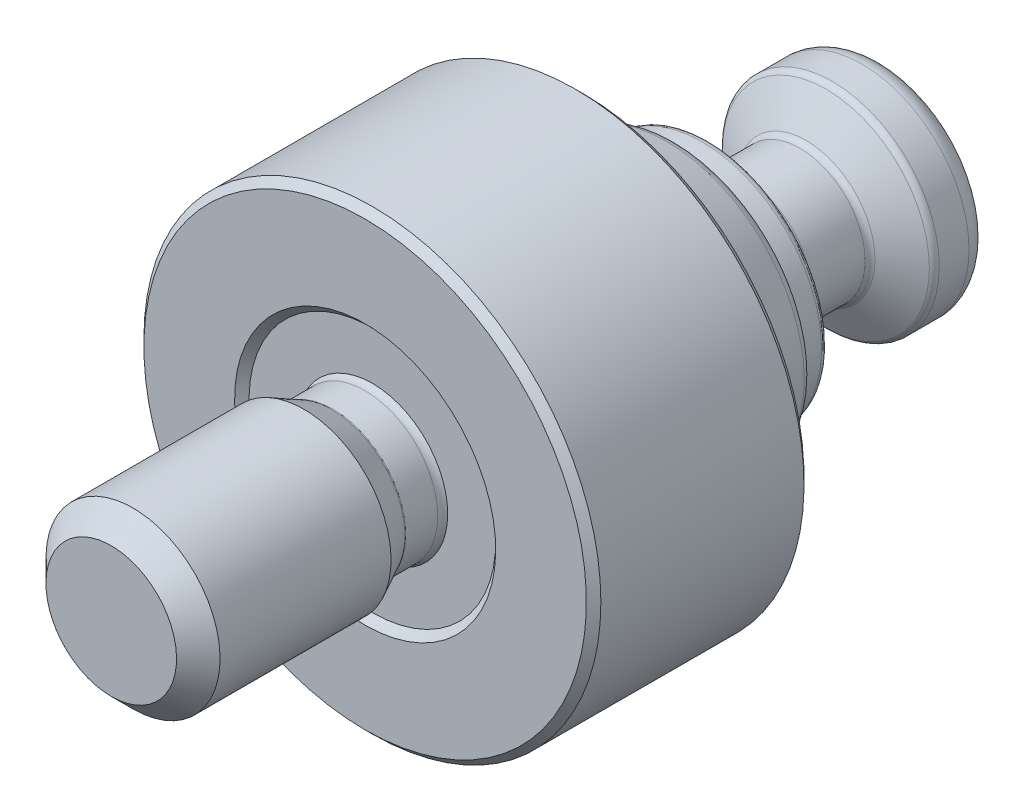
ISO-10303-21;
HEADER;
FILE_DESCRIPTION(('STEP AP214'),'2;1');
FILE_NAME('part.step','',(''),(''),'','','');
FILE_SCHEMA(('AUTOMOTIVE_DESIGN { 1 0 10303 214 1 1 1 1 }'));
ENDSEC;
DATA;
#1=APPLICATION_CONTEXT('core data for automotive mechanical design processes');
#2=APPLICATION_PROTOCOL_DEFINITION('international standard','automotive_design',2000,#1);
#3=PRODUCT_CONTEXT('',#1,'mechanical');
#4=PRODUCT('Part','Part','',(#3));
#5=PRODUCT_RELATED_PRODUCT_CATEGORY('part','',(#4));
#6=PRODUCT_DEFINITION_FORMATION('','',#4);
#7=PRODUCT_DEFINITION_CONTEXT('part definition',#1,'design');
#8=PRODUCT_DEFINITION('design','',#6,#7);
#9=PRODUCT_DEFINITION_SHAPE('','',#8);
#10=(LENGTH_UNIT() NAMED_UNIT(*) SI_UNIT(.MILLI.,.METRE.));
#11=(NAMED_UNIT(*) PLANE_ANGLE_UNIT() SI_UNIT($,.RADIAN.));
#12=(NAMED_UNIT(*) SI_UNIT($,.STERADIAN.) SOLID_ANGLE_UNIT());
#13=UNCERTAINTY_MEASURE_WITH_UNIT(LENGTH_MEASURE(1.E-05),#10,'distance_accuracy_value','');
#14=(GEOMETRIC_REPRESENTATION_CONTEXT(3) GLOBAL_UNCERTAINTY_ASSIGNED_CONTEXT((#13)) GLOBAL_UNIT_ASSIGNED_CONTEXT((#10,
#11,#12)) REPRESENTATION_CONTEXT('',''));
#15=CARTESIAN_POINT('',(0.,0.,0.));
#16=DIRECTION('',(0.,0.,1.));
#17=DIRECTION('',(1.,0.,0.));
#18=AXIS2_PLACEMENT_3D('',#15,#16,#17);
#19=CARTESIAN_POINT('',(0.,0.,29.));
#20=DIRECTION('',(0.,0.,-1.));
#21=DIRECTION('',(0.,1.,0.));
#22=AXIS2_PLACEMENT_3D('',#19,#20,#21);
#23=CONICAL_SURFACE('',#22,31.5,0.785398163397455);
#24=CARTESIAN_POINT('',(0.,0.,30.));
#25=DIRECTION('',(0.,0.,1.));
#26=DIRECTION('',(0.,-1.,0.));
#27=AXIS2_PLACEMENT_3D('',#24,#25,#26);
#28=CIRCLE('',#27,30.5);
#29=CARTESIAN_POINT('',(0.,-30.5,30.));
#30=VERTEX_POINT('',#29);
#31=EDGE_CURVE('E693',#30,#30,#28,.T.);
#32=ORIENTED_EDGE('',*,*,#31,.F.);
#33=EDGE_LOOP('',(#32));
#34=FACE_BOUND('',#33,.T.);
#35=CARTESIAN_POINT('',(0.,0.,29.));
#36=DIRECTION('',(0.,0.,1.));
#37=DIRECTION('',(0.,-1.,0.));
#38=AXIS2_PLACEMENT_3D('',#35,#36,#37);
#39=CIRCLE('',#38,31.5);
#40=CARTESIAN_POINT('',(0.,-31.5,29.));
#41=VERTEX_POINT('',#40);
#42=EDGE_CURVE('E702',#41,#41,#39,.F.);
#43=ORIENTED_EDGE('',*,*,#42,.F.);
#44=EDGE_LOOP('',(#43));
#45=FACE_BOUND('',#44,.T.);
#46=ADVANCED_FACE('F14',(#34,#45),#23,.T.);
#47=CARTESIAN_POINT('',(17.,0.,30.));
#48=DIRECTION('',(0.,0.,1.));
#49=DIRECTION('',(0.,-1.,0.));
#50=AXIS2_PLACEMENT_3D('',#47,#48,#49);
#51=PLANE('',#50);
#52=ORIENTED_EDGE('',*,*,#31,.T.);
#53=EDGE_LOOP('',(#52));
#54=FACE_BOUND('',#53,.T.);
#55=CARTESIAN_POINT('',(0.,0.,30.));
#56=DIRECTION('',(0.,0.,1.));
#57=DIRECTION('',(0.,-1.,0.));
#58=AXIS2_PLACEMENT_3D('',#55,#56,#57);
#59=CIRCLE('',#58,18.);
#60=CARTESIAN_POINT('',(0.,-18.,30.));
#61=VERTEX_POINT('',#60);
#62=EDGE_CURVE('E696',#61,#61,#59,.F.);
#63=ORIENTED_EDGE('',*,*,#62,.T.);
#64=EDGE_LOOP('',(#63));
#65=FACE_BOUND('',#64,.T.);
#66=ADVANCED_FACE('F586',(#54,#65),#51,.T.);
#67=CARTESIAN_POINT('',(0.,0.,30.));
#68=DIRECTION('',(0.,0.,1.));
#69=DIRECTION('',(0.,-1.,0.));
#70=AXIS2_PLACEMENT_3D('',#67,#68,#69);
#71=CONICAL_SURFACE('',#70,18.,0.785398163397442);
#72=CARTESIAN_POINT('',(0.,0.,29.));
#73=DIRECTION('',(0.,0.,1.));
#74=DIRECTION('',(0.,-1.,0.));
#75=AXIS2_PLACEMENT_3D('',#72,#73,#74);
#76=CIRCLE('',#75,17.);
#77=CARTESIAN_POINT('',(0.,-17.,29.));
#78=VERTEX_POINT('',#77);
#79=EDGE_CURVE('E690',#78,#78,#76,.T.);
#80=ORIENTED_EDGE('',*,*,#79,.F.);
#81=EDGE_LOOP('',(#80));
#82=FACE_BOUND('',#81,.T.);
#83=ORIENTED_EDGE('',*,*,#62,.F.);
#84=EDGE_LOOP('',(#83));
#85=FACE_BOUND('',#84,.T.);
#86=ADVANCED_FACE('F576',(#82,#85),#71,.F.);
#87=CARTESIAN_POINT('',(0.,0.,29.));
#88=DIRECTION('',(0.,0.,-1.));
#89=DIRECTION('',(0.,1.,0.));
#90=AXIS2_PLACEMENT_3D('',#87,#88,#89);
#91=PLANE('',#90);
#92=CARTESIAN_POINT('',(0.,0.,29.));
#93=DIRECTION('',(0.,0.,1.));
#94=DIRECTION('',(1.,0.,0.));
#95=AXIS2_PLACEMENT_3D('',#92,#93,#94);
#96=CIRCLE('',#95,10.3819660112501);
#97=CARTESIAN_POINT('',(10.3819660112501,0.,29.));
#98=VERTEX_POINT('',#97);
#99=EDGE_CURVE('E29',#98,#98,#96,.T.);
#100=ORIENTED_EDGE('',*,*,#99,.F.);
#101=EDGE_LOOP('',(#100));
#102=FACE_BOUND('',#101,.T.);
#103=ORIENTED_EDGE('',*,*,#79,.T.);
#104=EDGE_LOOP('',(#103));
#105=FACE_BOUND('',#104,.T.);
#106=ADVANCED_FACE('F566',(#102,#105),#91,.F.);
#107=CARTESIAN_POINT('',(0.,0.,-12.8632009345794));
#108=DIRECTION('',(0.,0.,-1.));
#109=DIRECTION('',(0.,1.,0.));
#110=AXIS2_PLACEMENT_3D('',#107,#108,#109);
#111=CYLINDRICAL_SURFACE('',#110,31.5);
#112=CARTESIAN_POINT('',(0.,0.,1.00000000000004));
#113=DIRECTION('',(0.,0.,-1.));
#114=DIRECTION('',(0.,1.,0.));
#115=AXIS2_PLACEMENT_3D('',#112,#113,#114);
#116=CIRCLE('',#115,31.5);
#117=CARTESIAN_POINT('',(0.,31.5,1.00000000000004));
#118=VERTEX_POINT('',#117);
#119=EDGE_CURVE('E699',#118,#118,#116,.F.);
#120=ORIENTED_EDGE('',*,*,#119,.T.);
#121=EDGE_LOOP('',(#120));
#122=FACE_BOUND('',#121,.T.);
#123=ORIENTED_EDGE('',*,*,#42,.T.);
#124=EDGE_LOOP('',(#123));
#125=FACE_BOUND('',#124,.T.);
#126=ADVANCED_FACE('F555',(#122,#125),#111,.T.);
#127=CARTESIAN_POINT('',(0.,0.,0.));
#128=DIRECTION('',(0.,0.,1.));
#129=DIRECTION('',(0.,-1.,0.));
#130=AXIS2_PLACEMENT_3D('',#127,#128,#129);
#131=CONICAL_SURFACE('',#130,30.5,0.785398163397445);
#132=ORIENTED_EDGE('',*,*,#119,.F.);
#133=EDGE_LOOP('',(#132));
#134=FACE_BOUND('',#133,.T.);
#135=CARTESIAN_POINT('',(0.,0.,0.));
#136=DIRECTION('',(0.,0.,-1.));
#137=DIRECTION('',(0.,1.,0.));
#138=AXIS2_PLACEMENT_3D('',#135,#136,#137);
#139=CIRCLE('',#138,30.5);
#140=CARTESIAN_POINT('',(0.,30.5,0.));
#141=VERTEX_POINT('',#140);
#142=EDGE_CURVE('E101',#141,#141,#139,.T.);
#143=ORIENTED_EDGE('',*,*,#142,.F.);
#144=EDGE_LOOP('',(#143));
#145=FACE_BOUND('',#144,.T.);
#146=ADVANCED_FACE('F251',(#134,#145),#131,.T.);
#147=CARTESIAN_POINT('',(17.,0.,0.));
#148=DIRECTION('',(0.,0.,-1.));
#149=DIRECTION('',(0.,1.,0.));
#150=AXIS2_PLACEMENT_3D('',#147,#148,#149);
#151=PLANE('',#150);
#152=CARTESIAN_POINT('',(0.,0.,0.));
#153=DIRECTION('',(0.,0.,-1.));
#154=DIRECTION('',(-1.,0.,0.));
#155=AXIS2_PLACEMENT_3D('',#152,#153,#154);
#156=CIRCLE('',#155,21.8);
#157=CARTESIAN_POINT('',(-21.8,0.,0.));
#158=VERTEX_POINT('',#157);
#159=EDGE_CURVE('E9',#158,#158,#156,.T.);
#160=ORIENTED_EDGE('',*,*,#159,.F.);
#161=EDGE_LOOP('',(#160));
#162=FACE_BOUND('',#161,.T.);
#163=ORIENTED_EDGE('',*,*,#142,.T.);
#164=EDGE_LOOP('',(#163));
#165=FACE_BOUND('',#164,.T.);
#166=ADVANCED_FACE('F211',(#162,#165),#151,.T.);
#167=CARTESIAN_POINT('',(0.,0.,65.));
#168=DIRECTION('',(0.,0.,1.));
#169=DIRECTION('',(0.,-1.,0.));
#170=AXIS2_PLACEMENT_3D('',#167,#168,#169);
#171=PLANE('',#170);
#172=CARTESIAN_POINT('',(0.,0.,65.));
#173=DIRECTION('',(0.,0.,1.));
#174=DIRECTION('',(0.,-1.,0.));
#175=AXIS2_PLACEMENT_3D('',#172,#173,#174);
#176=CIRCLE('',#175,9.);
#177=CARTESIAN_POINT('',(0.,-9.00000000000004,65.));
#178=VERTEX_POINT('',#177);
#179=EDGE_CURVE('E158',#178,#178,#176,.T.);
#180=ORIENTED_EDGE('',*,*,#179,.T.);
#181=EDGE_LOOP('',(#180));
#182=FACE_BOUND('',#181,.T.);
#183=ADVANCED_FACE('F239',(#182),#171,.T.);
#184=CARTESIAN_POINT('',(0.,0.,62.));
#185=DIRECTION('',(0.,0.,-1.));
#186=DIRECTION('',(0.,1.,0.));
#187=AXIS2_PLACEMENT_3D('',#184,#185,#186);
#188=CONICAL_SURFACE('',#187,12.,0.785398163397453);
#189=ORIENTED_EDGE('',*,*,#179,.F.);
#190=EDGE_LOOP('',(#189));
#191=FACE_BOUND('',#190,.T.);
#192=CARTESIAN_POINT('',(0.,0.,62.));
#193=DIRECTION('',(0.,0.,1.));
#194=DIRECTION('',(0.,-1.,0.));
#195=AXIS2_PLACEMENT_3D('',#192,#193,#194);
#196=CIRCLE('',#195,12.);
#197=CARTESIAN_POINT('',(0.,-12.,62.));
#198=VERTEX_POINT('',#197);
#199=EDGE_CURVE('E155',#198,#198,#196,.F.);
#200=ORIENTED_EDGE('',*,*,#199,.F.);
#201=EDGE_LOOP('',(#200));
#202=FACE_BOUND('',#201,.T.);
#203=ADVANCED_FACE('F241',(#191,#202),#188,.T.);
#204=CARTESIAN_POINT('',(0.,0.,-13.));
#205=DIRECTION('',(0.,0.,-1.));
#206=DIRECTION('',(0.,1.,0.));
#207=AXIS2_PLACEMENT_3D('',#204,#205,#206);
#208=CYLINDRICAL_SURFACE('',#207,12.);
#209=CARTESIAN_POINT('',(0.,0.,38.4252210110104));
#210=DIRECTION('',(0.,0.,1.));
#211=DIRECTION('',(0.,-1.,0.));
#212=AXIS2_PLACEMENT_3D('',#209,#210,#211);
#213=CIRCLE('',#212,12.);
#214=CARTESIAN_POINT('',(0.,-12.,38.4252210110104));
#215=VERTEX_POINT('',#214);
#216=EDGE_CURVE('E111',#215,#215,#213,.F.);
#217=ORIENTED_EDGE('',*,*,#216,.F.);
#218=EDGE_LOOP('',(#217));
#219=FACE_BOUND('',#218,.T.);
#220=ORIENTED_EDGE('',*,*,#199,.T.);
#221=EDGE_LOOP('',(#220));
#222=FACE_BOUND('',#221,.T.);
#223=ADVANCED_FACE('F249',(#219,#222),#208,.T.);
#224=CARTESIAN_POINT('',(0.,0.,39.406526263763));
#225=DIRECTION('',(0.,0.,1.));
#226=DIRECTION('',(0.,-1.,0.));
#227=AXIS2_PLACEMENT_3D('',#224,#225,#226);
#228=CONICAL_SURFACE('',#227,12.5,0.471238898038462);
#229=CARTESIAN_POINT('',(0.,0.,34.5855646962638));
#230=DIRECTION('',(0.,0.,1.));
#231=DIRECTION('',(0.,-1.,0.));
#232=AXIS2_PLACEMENT_3D('',#229,#230,#231);
#233=CIRCLE('',#232,10.0435973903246);
#234=CARTESIAN_POINT('',(0.,-10.0435973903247,34.5855646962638));
#235=VERTEX_POINT('',#234);
#236=EDGE_CURVE('E189',#235,#235,#233,.T.);
#237=ORIENTED_EDGE('',*,*,#236,.T.);
#238=EDGE_LOOP('',(#237));
#239=FACE_BOUND('',#238,.T.);
#240=ORIENTED_EDGE('',*,*,#216,.T.);
#241=EDGE_LOOP('',(#240));
#242=FACE_BOUND('',#241,.T.);
#243=ADVANCED_FACE('F263',(#239,#242),#228,.T.);
#244=CARTESIAN_POINT('',(0.,0.,34.4039684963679));
#245=DIRECTION('',(0.,0.,-1.));
#246=DIRECTION('',(0.,1.,0.));
#247=AXIS2_PLACEMENT_3D('',#244,#245,#246);
#248=TOROIDAL_SURFACE('',#247,10.4,0.4);
#249=ORIENTED_EDGE('',*,*,#236,.F.);
#250=EDGE_LOOP('',(#249));
#251=FACE_BOUND('',#250,.T.);
#252=CARTESIAN_POINT('',(0.,0.,34.4039684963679));
#253=DIRECTION('',(0.,0.,-1.));
#254=DIRECTION('',(0.,1.,0.));
#255=AXIS2_PLACEMENT_3D('',#252,#253,#254);
#256=CIRCLE('',#255,10.);
#257=CARTESIAN_POINT('',(0.,9.99999999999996,34.4039684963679));
#258=VERTEX_POINT('',#257);
#259=EDGE_CURVE('E186',#258,#258,#256,.T.);
#260=ORIENTED_EDGE('',*,*,#259,.F.);
#261=EDGE_LOOP('',(#260));
#262=FACE_BOUND('',#261,.T.);
#263=ADVANCED_FACE('F390',(#251,#262),#248,.F.);
#264=CARTESIAN_POINT('',(0.,0.,-15.1189031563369));
#265=DIRECTION('',(0.,0.,-1.));
#266=DIRECTION('',(0.,1.,0.));
#267=AXIS2_PLACEMENT_3D('',#264,#265,#266);
#268=CYLINDRICAL_SURFACE('',#267,10.);
#269=ORIENTED_EDGE('',*,*,#259,.T.);
#270=EDGE_LOOP('',(#269));
#271=FACE_BOUND('',#270,.T.);
#272=CARTESIAN_POINT('',(0.,0.,30.));
#273=DIRECTION('',(0.,0.,-1.));
#274=DIRECTION('',(0.,1.,0.));
#275=AXIS2_PLACEMENT_3D('',#272,#273,#274);
#276=CIRCLE('',#275,10.);
#277=CARTESIAN_POINT('',(0.,9.99999999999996,30.));
#278=VERTEX_POINT('',#277);
#279=EDGE_CURVE('E180',#278,#278,#276,.F.);
#280=ORIENTED_EDGE('',*,*,#279,.T.);
#281=EDGE_LOOP('',(#280));
#282=FACE_BOUND('',#281,.T.);
#283=ADVANCED_FACE('F380',(#271,#282),#268,.T.);
#284=CARTESIAN_POINT('',(0.,0.,30.));
#285=DIRECTION('',(0.,0.,-1.));
#286=DIRECTION('',(0.,1.,0.));
#287=AXIS2_PLACEMENT_3D('',#284,#285,#286);
#288=TOROIDAL_SURFACE('',#287,11.5,1.5);
#289=ORIENTED_EDGE('',*,*,#279,.F.);
#290=EDGE_LOOP('',(#289));
#291=FACE_BOUND('',#290,.T.);
#292=ORIENTED_EDGE('',*,*,#99,.T.);
#293=EDGE_LOOP('',(#292));
#294=FACE_BOUND('',#293,.T.);
#295=ADVANCED_FACE('F374',(#291,#294),#288,.F.);
#296=CARTESIAN_POINT('',(0.,0.,-32.1));
#297=DIRECTION('',(0.,0.,-1.));
#298=DIRECTION('',(0.,1.,0.));
#299=AXIS2_PLACEMENT_3D('',#296,#297,#298);
#300=CONICAL_SURFACE('',#299,4.,1.02974425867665);
#301=CARTESIAN_POINT('',(0.,0.,-29.6965575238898));
#302=VERTEX_POINT('',#301);
#303=VERTEX_LOOP('',#302);
#304=FACE_BOUND('',#303,.T.);
#305=CARTESIAN_POINT('',(0.,0.,-32.1));
#306=DIRECTION('',(0.,0.,-1.));
#307=DIRECTION('',(0.,1.,0.));
#308=AXIS2_PLACEMENT_3D('',#305,#306,#307);
#309=CIRCLE('',#308,4.);
#310=CARTESIAN_POINT('',(0.,3.99999999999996,-32.1));
#311=VERTEX_POINT('',#310);
#312=EDGE_CURVE('E128',#311,#311,#309,.T.);
#313=ORIENTED_EDGE('',*,*,#312,.T.);
#314=EDGE_LOOP('',(#313));
#315=FACE_BOUND('',#314,.T.);
#316=ADVANCED_FACE('F379',(#304,#315),#300,.F.);
#317=CARTESIAN_POINT('',(0.,0.,-41.5));
#318=DIRECTION('',(0.,0.,-1.));
#319=DIRECTION('',(0.,1.,0.));
#320=AXIS2_PLACEMENT_3D('',#317,#318,#319);
#321=CYLINDRICAL_SURFACE('',#320,4.);
#322=ORIENTED_EDGE('',*,*,#312,.F.);
#323=EDGE_LOOP('',(#322));
#324=FACE_BOUND('',#323,.T.);
#325=CARTESIAN_POINT('',(0.,0.,-36.));
#326=DIRECTION('',(0.,0.,-1.));
#327=DIRECTION('',(0.,1.,0.));
#328=AXIS2_PLACEMENT_3D('',#325,#326,#327);
#329=CIRCLE('',#328,4.);
#330=CARTESIAN_POINT('',(0.,3.99999999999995,-36.));
#331=VERTEX_POINT('',#330);
#332=CARTESIAN_POINT('',(-3.46410161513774,1.99999999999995,-36.));
#333=VERTEX_POINT('',#332);
#334=EDGE_CURVE('E170',#331,#333,#329,.F.);
#335=ORIENTED_EDGE('',*,*,#334,.F.);
#336=CARTESIAN_POINT('',(3.46410161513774,1.99999999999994,-36.));
#337=VERTEX_POINT('',#336);
#338=EDGE_CURVE('E167',#337,#331,#329,.F.);
#339=ORIENTED_EDGE('',*,*,#338,.F.);
#340=CARTESIAN_POINT('',(3.46410161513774,-2.00000000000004,-36.));
#341=VERTEX_POINT('',#340);
#342=EDGE_CURVE('E169',#341,#337,#329,.F.);
#343=ORIENTED_EDGE('',*,*,#342,.F.);
#344=CARTESIAN_POINT('',(0.,-4.,-36.));
#345=VERTEX_POINT('',#344);
#346=EDGE_CURVE('E734',#345,#341,#329,.F.);
#347=ORIENTED_EDGE('',*,*,#346,.F.);
#348=CARTESIAN_POINT('',(-3.46410161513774,-2.00000000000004,-36.));
#349=VERTEX_POINT('',#348);
#350=EDGE_CURVE('E733',#349,#345,#329,.F.);
#351=ORIENTED_EDGE('',*,*,#350,.F.);
#352=EDGE_CURVE('E732',#333,#349,#329,.F.);
#353=ORIENTED_EDGE('',*,*,#352,.F.);
#354=EDGE_LOOP('',(#335,#339,#343,#347,#351,#353));
#355=FACE_BOUND('',#354,.T.);
#356=ADVANCED_FACE('F497',(#324,#355),#321,.F.);
#357=CARTESIAN_POINT('',(0.,0.,-36.));
#358=DIRECTION('',(0.,0.,-1.));
#359=DIRECTION('',(0.,1.,0.));
#360=AXIS2_PLACEMENT_3D('',#357,#358,#359);
#361=PLANE('',#360);
#362=ORIENTED_EDGE('',*,*,#346,.T.);
#363=DIRECTION('',(-0.5,-0.866025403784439,0.));
#364=VECTOR('',#363,1.);
#365=CARTESIAN_POINT('',(4.61880215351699,0.,-36.));
#366=LINE('',#365,#364);
#367=CARTESIAN_POINT('',(2.30940107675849,-4.,-36.));
#368=VERTEX_POINT('',#367);
#369=EDGE_CURVE('E656',#341,#368,#366,.T.);
#370=ORIENTED_EDGE('',*,*,#369,.T.);
#371=DIRECTION('',(-1.,0.,0.));
#372=VECTOR('',#371,1.);
#373=CARTESIAN_POINT('',(2.30940107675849,-4.,-36.));
#374=LINE('',#373,#372);
#375=EDGE_CURVE('E659',#368,#345,#374,.T.);
#376=ORIENTED_EDGE('',*,*,#375,.T.);
#377=EDGE_LOOP('',(#362,#370,#376));
#378=FACE_BOUND('',#377,.T.);
#379=ADVANCED_FACE('F475',(#378),#361,.T.);
#380=ORIENTED_EDGE('',*,*,#350,.T.);
#381=CARTESIAN_POINT('',(-2.30940107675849,-4.,-36.));
#382=VERTEX_POINT('',#381);
#383=EDGE_CURVE('E658',#345,#382,#374,.T.);
#384=ORIENTED_EDGE('',*,*,#383,.T.);
#385=DIRECTION('',(-0.5,0.866025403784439,0.));
#386=VECTOR('',#385,1.);
#387=CARTESIAN_POINT('',(-2.30940107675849,-4.,-36.));
#388=LINE('',#387,#386);
#389=EDGE_CURVE('E663',#382,#349,#388,.T.);
#390=ORIENTED_EDGE('',*,*,#389,.T.);
#391=EDGE_LOOP('',(#380,#384,#390));
#392=FACE_BOUND('',#391,.T.);
#393=ADVANCED_FACE('F469',(#392),#361,.T.);
#394=ORIENTED_EDGE('',*,*,#352,.T.);
#395=CARTESIAN_POINT('',(-4.61880215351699,0.,-36.));
#396=VERTEX_POINT('',#395);
#397=EDGE_CURVE('E662',#349,#396,#388,.T.);
#398=ORIENTED_EDGE('',*,*,#397,.T.);
#399=DIRECTION('',(0.5,0.866025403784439,0.));
#400=VECTOR('',#399,1.);
#401=CARTESIAN_POINT('',(-4.61880215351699,0.,-36.));
#402=LINE('',#401,#400);
#403=EDGE_CURVE('E667',#396,#333,#402,.T.);
#404=ORIENTED_EDGE('',*,*,#403,.T.);
#405=EDGE_LOOP('',(#394,#398,#404));
#406=FACE_BOUND('',#405,.T.);
#407=ADVANCED_FACE('F474',(#406),#361,.T.);
#408=ORIENTED_EDGE('',*,*,#334,.T.);
#409=CARTESIAN_POINT('',(-2.30940107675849,3.99999999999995,-36.));
#410=VERTEX_POINT('',#409);
#411=EDGE_CURVE('E666',#333,#410,#402,.T.);
#412=ORIENTED_EDGE('',*,*,#411,.T.);
#413=DIRECTION('',(1.,0.,0.));
#414=VECTOR('',#413,1.);
#415=CARTESIAN_POINT('',(-2.30940107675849,3.99999999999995,-36.));
#416=LINE('',#415,#414);
#417=EDGE_CURVE('E119',#410,#331,#416,.T.);
#418=ORIENTED_EDGE('',*,*,#417,.T.);
#419=EDGE_LOOP('',(#408,#412,#418));
#420=FACE_BOUND('',#419,.T.);
#421=ADVANCED_FACE('F488',(#420),#361,.T.);
#422=ORIENTED_EDGE('',*,*,#338,.T.);
#423=CARTESIAN_POINT('',(2.30940107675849,3.99999999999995,-36.));
#424=VERTEX_POINT('',#423);
#425=EDGE_CURVE('E124',#331,#424,#416,.T.);
#426=ORIENTED_EDGE('',*,*,#425,.T.);
#427=DIRECTION('',(0.5,-0.866025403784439,0.));
#428=VECTOR('',#427,1.);
#429=CARTESIAN_POINT('',(2.30940107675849,3.99999999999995,-36.));
#430=LINE('',#429,#428);
#431=EDGE_CURVE('E45',#424,#337,#430,.T.);
#432=ORIENTED_EDGE('',*,*,#431,.T.);
#433=EDGE_LOOP('',(#422,#426,#432));
#434=FACE_BOUND('',#433,.T.);
#435=ADVANCED_FACE('F508',(#434),#361,.T.);
#436=ORIENTED_EDGE('',*,*,#342,.T.);
#437=CARTESIAN_POINT('',(4.61880215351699,0.,-36.));
#438=VERTEX_POINT('',#437);
#439=EDGE_CURVE('E654',#337,#438,#430,.T.);
#440=ORIENTED_EDGE('',*,*,#439,.T.);
#441=EDGE_CURVE('E117',#438,#341,#366,.T.);
#442=ORIENTED_EDGE('',*,*,#441,.T.);
#443=EDGE_LOOP('',(#436,#440,#442));
#444=FACE_BOUND('',#443,.T.);
#445=ADVANCED_FACE('F478',(#444),#361,.T.);
#446=CARTESIAN_POINT('',(4.61880215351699,0.,-36.));
#447=DIRECTION('',(0.866025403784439,-0.5,0.));
#448=DIRECTION('',(0.5,0.866025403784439,0.));
#449=AXIS2_PLACEMENT_3D('',#446,#447,#448);
#450=PLANE('',#449);
#451=CARTESIAN_POINT('',(2.30928560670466,-4.0002,-41.2799819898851));
#452=CARTESIAN_POINT('',(2.41077174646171,-3.82442084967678,-41.2213676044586));
#453=CARTESIAN_POINT('',(2.513133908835,-3.64712438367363,-41.1680600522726));
#454=CARTESIAN_POINT('',(2.71963072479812,-3.28946140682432,-41.0750114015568));
#455=CARTESIAN_POINT('',(2.82376904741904,-3.10908854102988,-41.0353032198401));
#456=CARTESIAN_POINT('',(3.03075510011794,-2.75057818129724,-40.9734919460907));
#457=CARTESIAN_POINT('',(3.13357098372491,-2.57249584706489,-40.9509774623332));
#458=CARTESIAN_POINT('',(3.33968651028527,-2.21549328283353,-40.924100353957));
#459=CARTESIAN_POINT('',(3.44298540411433,-2.03657435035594,-40.9197154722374));
#460=CARTESIAN_POINT('',(3.63600352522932,-1.70225715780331,-40.9288398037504));
#461=CARTESIAN_POINT('',(3.72575165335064,-1.54680884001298,-40.9401086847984));
#462=CARTESIAN_POINT('',(3.90466320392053,-1.23692494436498,-40.9758237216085));
#463=CARTESIAN_POINT('',(3.99382600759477,-1.08249043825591,-41.0002820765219));
#464=CARTESIAN_POINT('',(4.17310641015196,-0.771967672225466,-41.0614257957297));
#465=CARTESIAN_POINT('',(4.2632013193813,-0.615918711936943,-41.0983703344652));
#466=CARTESIAN_POINT('',(4.44204742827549,-0.306148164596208,-41.1822198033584));
#467=CARTESIAN_POINT('',(4.53080091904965,-0.152422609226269,-41.2291050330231));
#468=CARTESIAN_POINT('',(4.61891762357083,0.000199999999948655,-41.2799819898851));
#469=B_SPLINE_CURVE_WITH_KNOTS('',3,(#451,#452,#453,#454,#455,#456,#457,#458,#459,#460,#461,
#462,#463,#464,#465,#466,#467,#468),.UNSPECIFIED.,.F.,.F.,(4,2,2,2,2,2,2,2,4),(0.,
0.634047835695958,1.26961969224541,1.88946157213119,2.50854226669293,3.04757825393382,
3.587113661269,4.13861653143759,4.68903648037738),.UNSPECIFIED.);
#470=CARTESIAN_POINT('',(2.30940107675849,-4.,-41.2799153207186));
#471=VERTEX_POINT('',#470);
#472=CARTESIAN_POINT('',(4.61880215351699,0.,-41.2799153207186));
#473=VERTEX_POINT('',#472);
#474=EDGE_CURVE('E18',#471,#473,#469,.T.);
#475=ORIENTED_EDGE('',*,*,#474,.F.);
#476=DIRECTION('',(0.,0.,-1.));
#477=VECTOR('',#476,1.);
#478=CARTESIAN_POINT('',(2.30940107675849,-4.,-36.));
#479=LINE('',#478,#477);
#480=EDGE_CURVE('E118',#368,#471,#479,.T.);
#481=ORIENTED_EDGE('',*,*,#480,.F.);
#482=ORIENTED_EDGE('',*,*,#369,.F.);
#483=ORIENTED_EDGE('',*,*,#441,.F.);
#484=DIRECTION('',(0.,0.,-1.));
#485=VECTOR('',#484,1.);
#486=CARTESIAN_POINT('',(4.61880215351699,0.,-36.));
#487=LINE('',#486,#485);
#488=EDGE_CURVE('E107',#438,#473,#487,.T.);
#489=ORIENTED_EDGE('',*,*,#488,.T.);
#490=EDGE_LOOP('',(#475,#481,#482,#483,#489));
#491=FACE_BOUND('',#490,.T.);
#492=ADVANCED_FACE('F114',(#491),#450,.F.);
#493=CARTESIAN_POINT('',(2.30940107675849,-4.,-36.));
#494=DIRECTION('',(0.,-1.,0.));
#495=DIRECTION('',(1.,0.,0.));
#496=AXIS2_PLACEMENT_3D('',#493,#494,#495);
#497=PLANE('',#496);
#498=CARTESIAN_POINT('',(-6.11536351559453,-4.,-42.8321612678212));
#499=CARTESIAN_POINT('',(-5.94136455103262,-4.,-42.7481138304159));
#500=CARTESIAN_POINT('',(-5.76695654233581,-4.,-42.6648982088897));
#501=CARTESIAN_POINT('',(-5.41710453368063,-4.,-42.5006003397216));
#502=CARTESIAN_POINT('',(-5.24166036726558,-4.,-42.4195184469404));
#503=CARTESIAN_POINT('',(-4.88857129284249,-4.,-42.2595308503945));
#504=CARTESIAN_POINT('',(-4.71091953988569,-4.,-42.1806401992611));
#505=CARTESIAN_POINT('',(-4.3541717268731,-4.,-42.0262076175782));
#506=CARTESIAN_POINT('',(-4.17507573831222,-4.,-41.9506655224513));
#507=CARTESIAN_POINT('',(-3.80974659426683,-4.,-41.8016107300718));
#508=CARTESIAN_POINT('',(-3.62346053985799,-4.,-41.7282269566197));
#509=CARTESIAN_POINT('',(-3.24867678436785,-4.,-41.5872295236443));
#510=CARTESIAN_POINT('',(-3.06017883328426,-4.,-41.5196165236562));
#511=CARTESIAN_POINT('',(-2.68105362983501,-4.,-41.3920002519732));
#512=CARTESIAN_POINT('',(-2.49043188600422,-4.,-41.3319807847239));
#513=CARTESIAN_POINT('',(-2.10645638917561,-4.,-41.2215351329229));
#514=CARTESIAN_POINT('',(-1.91310354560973,-4.,-41.1711058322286));
#515=CARTESIAN_POINT('',(-1.52459990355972,-4.,-41.0825776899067));
#516=CARTESIAN_POINT('',(-1.32946366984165,-4.,-41.0444161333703));
#517=CARTESIAN_POINT('',(-0.936859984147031,-4.,-40.9826444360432));
#518=CARTESIAN_POINT('',(-0.739392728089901,-4.,-40.9590330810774));
#519=CARTESIAN_POINT('',(-0.345654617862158,-4.,-40.9285556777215));
#520=CARTESIAN_POINT('',(-0.14940029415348,-4.,-40.9214813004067));
#521=CARTESIAN_POINT('',(0.243008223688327,-4.,-40.9241343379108));
#522=CARTESIAN_POINT('',(0.439162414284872,-4.,-40.9338623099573));
#523=CARTESIAN_POINT('',(0.774833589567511,-4.,-40.9642118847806));
#524=CARTESIAN_POINT('',(0.914717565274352,-4.,-40.9809861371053));
#525=CARTESIAN_POINT('',(1.19339686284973,-4.,-41.0219863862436));
#526=CARTESIAN_POINT('',(1.33219202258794,-4.,-41.0462134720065));
#527=CARTESIAN_POINT('',(1.74679493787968,-4.,-41.1287935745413));
#528=CARTESIAN_POINT('',(2.02065290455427,-4.,-41.1970283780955));
#529=CARTESIAN_POINT('',(2.43006674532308,-4.,-41.314532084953));
#530=CARTESIAN_POINT('',(2.5677639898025,-4.,-41.3567577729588));
#531=CARTESIAN_POINT('',(2.84181962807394,-4.,-41.4453888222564));
#532=CARTESIAN_POINT('',(2.97817801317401,-4.,-41.4917942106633));
#533=CARTESIAN_POINT('',(3.24960349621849,-4.,-41.5880571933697));
#534=CARTESIAN_POINT('',(3.38467104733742,-4.,-41.6379135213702));
#535=CARTESIAN_POINT('',(3.65370081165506,-4.,-41.7405124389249));
#536=CARTESIAN_POINT('',(3.78766303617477,-4.,-41.7932549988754));
#537=CARTESIAN_POINT('',(4.09701986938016,-4.,-41.9182840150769));
#538=CARTESIAN_POINT('',(4.27205588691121,-4.,-41.991455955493));
#539=CARTESIAN_POINT('',(4.62071132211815,-4.,-42.141108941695));
#540=CARTESIAN_POINT('',(4.79433066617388,-4.,-42.2175901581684));
#541=CARTESIAN_POINT('',(5.14040670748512,-4.,-42.373213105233));
#542=CARTESIAN_POINT('',(5.31286319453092,-4.,-42.4523553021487));
#543=CARTESIAN_POINT('',(5.65677659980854,-4.,-42.6127855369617));
#544=CARTESIAN_POINT('',(5.8282334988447,-4.,-42.6940736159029));
#545=CARTESIAN_POINT('',(6.34165551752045,-4.,-42.9406928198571));
#546=CARTESIAN_POINT('',(6.68236404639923,-4.,-43.1086386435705));
#547=CARTESIAN_POINT('',(7.36139047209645,-4.,-43.4492937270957));
#548=CARTESIAN_POINT('',(7.69970828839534,-4.,-43.6220031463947));
#549=CARTESIAN_POINT('',(8.34749653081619,-4.,-43.9568309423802));
#550=CARTESIAN_POINT('',(8.65710289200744,-4.,-44.1186868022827));
#551=CARTESIAN_POINT('',(9.27517825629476,-4.,-44.4445752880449));
#552=CARTESIAN_POINT('',(9.58364722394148,-4.,-44.6086079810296));
#553=CARTESIAN_POINT('',(10.1989977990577,-4.,-44.937968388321));
#554=CARTESIAN_POINT('',(10.5058814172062,-4.,-45.1032923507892));
#555=CARTESIAN_POINT('',(11.11891782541,-4.,-45.4352539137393));
#556=CARTESIAN_POINT('',(11.4250706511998,-4.,-45.6018914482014));
#557=CARTESIAN_POINT('',(11.7309525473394,-4.,-45.7690213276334));
#558=B_SPLINE_CURVE_WITH_KNOTS('',3,(#498,#499,#500,#501,#502,#503,#504,#505,#506,#507,#508,
#509,#510,#511,#512,#513,#514,#515,#516,#517,#518,#519,#520,#521,#522,#523,#524,#525,#526,#527,
#528,#529,#530,#531,#532,#533,#534,#535,#536,#537,#538,#539,#540,#541,#542,#543,#544,#545,#546,
#547,#548,#549,#550,#551,#552,#553,#554,#555,#556,#557),.UNSPECIFIED.,.F.,.F.,(4,2,2,2,2,2,2,2,
2,2,2,2,2,2,2,2,2,2,2,2,2,2,2,2,2,2,2,2,2,4),(0.,0.579711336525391,1.15951848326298,
1.74263314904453,2.32571912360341,2.92630247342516,3.52695437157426,4.12630278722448,
4.72545612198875,5.32149588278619,5.91748589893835,6.50592633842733,7.09438629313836,
7.51683805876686,7.93935157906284,8.78488063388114,9.21692534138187,9.64897285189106,
10.0808626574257,10.512748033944,11.0818474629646,11.650976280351,12.220205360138,
12.7894453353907,13.9289401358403,15.0684731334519,16.1165460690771,17.1646513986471,
18.2103945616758,19.2560854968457),.UNSPECIFIED.);
#559=CARTESIAN_POINT('',(-2.30940107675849,-4.,-41.2799153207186));
#560=VERTEX_POINT('',#559);
#561=EDGE_CURVE('E37',#560,#471,#558,.T.);
#562=ORIENTED_EDGE('',*,*,#561,.F.);
#563=DIRECTION('',(0.,0.,-1.));
#564=VECTOR('',#563,1.);
#565=CARTESIAN_POINT('',(-2.30940107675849,-4.,-36.));
#566=LINE('',#565,#564);
#567=EDGE_CURVE('E121',#382,#560,#566,.T.);
#568=ORIENTED_EDGE('',*,*,#567,.F.);
#569=ORIENTED_EDGE('',*,*,#383,.F.);
#570=ORIENTED_EDGE('',*,*,#375,.F.);
#571=ORIENTED_EDGE('',*,*,#480,.T.);
#572=EDGE_LOOP('',(#562,#568,#569,#570,#571));
#573=FACE_BOUND('',#572,.T.);
#574=ADVANCED_FACE('F452',(#573),#497,.F.);
#575=CARTESIAN_POINT('',(-2.30940107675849,-4.,-36.));
#576=DIRECTION('',(-0.866025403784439,-0.5,0.));
#577=DIRECTION('',(0.5,-0.866025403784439,0.));
#578=AXIS2_PLACEMENT_3D('',#575,#576,#577);
#579=PLANE('',#578);
#580=CARTESIAN_POINT('',(-4.61891762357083,0.000199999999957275,-41.2799819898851));
#581=CARTESIAN_POINT('',(-4.51743148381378,-0.175579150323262,-41.2213676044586));
#582=CARTESIAN_POINT('',(-4.41506932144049,-0.352875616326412,-41.1680600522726));
#583=CARTESIAN_POINT('',(-4.20857250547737,-0.710538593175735,-41.0750114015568));
#584=CARTESIAN_POINT('',(-4.10443418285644,-0.890911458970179,-41.0353032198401));
#585=CARTESIAN_POINT('',(-3.89744813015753,-1.24942181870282,-40.9734919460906));
#586=CARTESIAN_POINT('',(-3.79463224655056,-1.42750415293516,-40.9509774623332));
#587=CARTESIAN_POINT('',(-3.58851671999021,-1.78450671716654,-40.924100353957));
#588=CARTESIAN_POINT('',(-3.48521782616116,-1.96342564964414,-40.9197154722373));
#589=CARTESIAN_POINT('',(-3.29219970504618,-2.29774284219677,-40.9288398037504));
#590=CARTESIAN_POINT('',(-3.20245157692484,-2.4531911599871,-40.9401086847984));
#591=CARTESIAN_POINT('',(-3.02354002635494,-2.76307505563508,-40.9758237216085));
#592=CARTESIAN_POINT('',(-2.9343772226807,-2.91750956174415,-41.0002820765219));
#593=CARTESIAN_POINT('',(-2.75509682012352,-3.2280323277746,-41.0614257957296));
#594=CARTESIAN_POINT('',(-2.66500191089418,-3.38408128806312,-41.0983703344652));
#595=CARTESIAN_POINT('',(-2.48615580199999,-3.69385183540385,-41.1822198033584));
#596=CARTESIAN_POINT('',(-2.39740231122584,-3.84757739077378,-41.2291050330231));
#597=CARTESIAN_POINT('',(-2.30928560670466,-4.0002,-41.2799819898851));
#598=B_SPLINE_CURVE_WITH_KNOTS('',3,(#580,#581,#582,#583,#584,#585,#586,#587,#588,#589,#590,
#591,#592,#593,#594,#595,#596,#597),.UNSPECIFIED.,.F.,.F.,(4,2,2,2,2,2,2,2,4),(0.,
0.634047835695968,1.26961969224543,1.88946157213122,2.50854226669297,3.04757825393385,
3.58711366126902,4.13861653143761,4.6890364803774),.UNSPECIFIED.);
#599=CARTESIAN_POINT('',(-4.61880215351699,0.,-41.2799153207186));
#600=VERTEX_POINT('',#599);
#601=EDGE_CURVE('E625',#600,#560,#598,.T.);
#602=ORIENTED_EDGE('',*,*,#601,.F.);
#603=DIRECTION('',(0.,0.,-1.));
#604=VECTOR('',#603,1.);
#605=CARTESIAN_POINT('',(-4.61880215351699,0.,-36.));
#606=LINE('',#605,#604);
#607=EDGE_CURVE('E674',#396,#600,#606,.T.);
#608=ORIENTED_EDGE('',*,*,#607,.F.);
#609=ORIENTED_EDGE('',*,*,#397,.F.);
#610=ORIENTED_EDGE('',*,*,#389,.F.);
#611=ORIENTED_EDGE('',*,*,#567,.T.);
#612=EDGE_LOOP('',(#602,#608,#609,#610,#611));
#613=FACE_BOUND('',#612,.T.);
#614=ADVANCED_FACE('F442',(#613),#579,.F.);
#615=CARTESIAN_POINT('',(-4.61880215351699,0.,-36.));
#616=DIRECTION('',(-0.866025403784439,0.5,0.));
#617=DIRECTION('',(-0.5,-0.866025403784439,0.));
#618=AXIS2_PLACEMENT_3D('',#615,#616,#617);
#619=PLANE('',#618);
#620=CARTESIAN_POINT('',(-2.30928560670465,4.00019999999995,-41.2799819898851));
#621=CARTESIAN_POINT('',(-2.41077174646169,3.82442084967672,-41.2213676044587));
#622=CARTESIAN_POINT('',(-2.51313390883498,3.64712438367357,-41.1680600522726));
#623=CARTESIAN_POINT('',(-2.71963072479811,3.28946140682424,-41.0750114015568));
#624=CARTESIAN_POINT('',(-2.82376904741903,3.1090885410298,-41.0353032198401));
#625=CARTESIAN_POINT('',(-3.03075510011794,2.75057818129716,-40.9734919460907));
#626=CARTESIAN_POINT('',(-3.13357098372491,2.57249584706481,-40.9509774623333));
#627=CARTESIAN_POINT('',(-3.33968651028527,2.21549328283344,-40.924100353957));
#628=CARTESIAN_POINT('',(-3.44298540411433,2.03657435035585,-40.9197154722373));
#629=CARTESIAN_POINT('',(-3.63600352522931,1.70225715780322,-40.9288398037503));
#630=CARTESIAN_POINT('',(-3.72575165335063,1.54680884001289,-40.9401086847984));
#631=CARTESIAN_POINT('',(-3.90466320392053,1.2369249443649,-40.9758237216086));
#632=CARTESIAN_POINT('',(-3.99382600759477,1.08249043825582,-41.0002820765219));
#633=CARTESIAN_POINT('',(-4.17310641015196,0.771967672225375,-41.0614257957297));
#634=CARTESIAN_POINT('',(-4.2632013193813,0.615918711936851,-41.0983703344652));
#635=CARTESIAN_POINT('',(-4.44204742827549,0.306148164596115,-41.1822198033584));
#636=CARTESIAN_POINT('',(-4.53080091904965,0.152422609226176,-41.2291050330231));
#637=CARTESIAN_POINT('',(-4.61891762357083,-0.000200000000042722,-41.2799819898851));
#638=B_SPLINE_CURVE_WITH_KNOTS('',3,(#620,#621,#622,#623,#624,#625,#626,#627,#628,#629,#630,
#631,#632,#633,#634,#635,#636,#637),.UNSPECIFIED.,.F.,.F.,(4,2,2,2,2,2,2,2,4),(0.,
0.634047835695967,1.26961969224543,1.88946157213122,2.50854226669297,3.04757825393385,
3.58711366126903,4.13861653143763,4.68903648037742),.UNSPECIFIED.);
#639=CARTESIAN_POINT('',(-2.30940107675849,3.99999999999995,-41.2799153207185));
#640=VERTEX_POINT('',#639);
#641=EDGE_CURVE('E631',#640,#600,#638,.T.);
#642=ORIENTED_EDGE('',*,*,#641,.F.);
#643=DIRECTION('',(0.,0.,-1.));
#644=VECTOR('',#643,1.);
#645=CARTESIAN_POINT('',(-2.30940107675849,3.99999999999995,-36.));
#646=LINE('',#645,#644);
#647=EDGE_CURVE('E671',#410,#640,#646,.T.);
#648=ORIENTED_EDGE('',*,*,#647,.F.);
#649=ORIENTED_EDGE('',*,*,#411,.F.);
#650=ORIENTED_EDGE('',*,*,#403,.F.);
#651=ORIENTED_EDGE('',*,*,#607,.T.);
#652=EDGE_LOOP('',(#642,#648,#649,#650,#651));
#653=FACE_BOUND('',#652,.T.);
#654=ADVANCED_FACE('F432',(#653),#619,.F.);
#655=CARTESIAN_POINT('',(-2.30940107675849,3.99999999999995,-36.));
#656=DIRECTION('',(0.,1.,0.));
#657=DIRECTION('',(-1.,0.,0.));
#658=AXIS2_PLACEMENT_3D('',#655,#656,#657);
#659=PLANE('',#658);
#660=CARTESIAN_POINT('',(-6.11536351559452,3.99999999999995,-42.8321612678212));
#661=CARTESIAN_POINT('',(-5.94136455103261,3.99999999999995,-42.7481138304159));
#662=CARTESIAN_POINT('',(-5.7669565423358,3.99999999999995,-42.6648982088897));
#663=CARTESIAN_POINT('',(-5.41710453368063,3.99999999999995,-42.5006003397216));
#664=CARTESIAN_POINT('',(-5.24166036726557,3.99999999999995,-42.4195184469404));
#665=CARTESIAN_POINT('',(-4.88857129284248,3.99999999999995,-42.2595308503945));
#666=CARTESIAN_POINT('',(-4.71091953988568,3.99999999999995,-42.1806401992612));
#667=CARTESIAN_POINT('',(-4.3541717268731,3.99999999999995,-42.0262076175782));
#668=CARTESIAN_POINT('',(-4.17507573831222,3.99999999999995,-41.9506655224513));
#669=CARTESIAN_POINT('',(-3.80974659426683,3.99999999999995,-41.8016107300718));
#670=CARTESIAN_POINT('',(-3.62346053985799,3.99999999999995,-41.7282269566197));
#671=CARTESIAN_POINT('',(-3.24867678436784,3.99999999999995,-41.5872295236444));
#672=CARTESIAN_POINT('',(-3.06017883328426,3.99999999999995,-41.5196165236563));
#673=CARTESIAN_POINT('',(-2.681053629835,3.99999999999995,-41.3920002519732));
#674=CARTESIAN_POINT('',(-2.4904318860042,3.99999999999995,-41.331980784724));
#675=CARTESIAN_POINT('',(-2.1064563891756,3.99999999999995,-41.2215351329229));
#676=CARTESIAN_POINT('',(-1.91310354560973,3.99999999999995,-41.1711058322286));
#677=CARTESIAN_POINT('',(-1.52459990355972,3.99999999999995,-41.0825776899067));
#678=CARTESIAN_POINT('',(-1.32946366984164,3.99999999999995,-41.0444161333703));
#679=CARTESIAN_POINT('',(-0.936859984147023,3.99999999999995,-40.9826444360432));
#680=CARTESIAN_POINT('',(-0.739392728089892,3.99999999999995,-40.9590330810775));
#681=CARTESIAN_POINT('',(-0.345654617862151,3.99999999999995,-40.9285556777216));
#682=CARTESIAN_POINT('',(-0.149400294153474,3.99999999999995,-40.9214813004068));
#683=CARTESIAN_POINT('',(0.243008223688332,3.99999999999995,-40.9241343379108));
#684=CARTESIAN_POINT('',(0.439162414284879,3.99999999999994,-40.9338623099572));
#685=CARTESIAN_POINT('',(0.774833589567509,3.99999999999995,-40.9642118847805));
#686=CARTESIAN_POINT('',(0.914717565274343,3.99999999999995,-40.9809861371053));
#687=CARTESIAN_POINT('',(1.19339686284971,3.99999999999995,-41.0219863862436));
#688=CARTESIAN_POINT('',(1.33219202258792,3.99999999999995,-41.0462134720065));
#689=CARTESIAN_POINT('',(1.74679493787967,3.99999999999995,-41.1287935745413));
#690=CARTESIAN_POINT('',(2.02065290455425,3.99999999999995,-41.1970283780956));
#691=CARTESIAN_POINT('',(2.43006674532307,3.99999999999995,-41.314532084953));
#692=CARTESIAN_POINT('',(2.56776398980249,3.99999999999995,-41.3567577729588));
#693=CARTESIAN_POINT('',(2.84181962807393,3.99999999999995,-41.4453888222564));
#694=CARTESIAN_POINT('',(2.97817801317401,3.99999999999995,-41.4917942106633));
#695=CARTESIAN_POINT('',(3.24960349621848,3.99999999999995,-41.5880571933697));
#696=CARTESIAN_POINT('',(3.38467104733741,3.99999999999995,-41.6379135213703));
#697=CARTESIAN_POINT('',(3.65370081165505,3.99999999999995,-41.740512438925));
#698=CARTESIAN_POINT('',(3.78766303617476,3.99999999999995,-41.7932549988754));
#699=CARTESIAN_POINT('',(4.09701986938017,3.99999999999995,-41.9182840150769));
#700=CARTESIAN_POINT('',(4.27205588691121,3.99999999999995,-41.991455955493));
#701=CARTESIAN_POINT('',(4.62071132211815,3.99999999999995,-42.141108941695));
#702=CARTESIAN_POINT('',(4.79433066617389,3.99999999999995,-42.2175901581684));
#703=CARTESIAN_POINT('',(5.14040670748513,3.99999999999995,-42.373213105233));
#704=CARTESIAN_POINT('',(5.31286319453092,3.99999999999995,-42.4523553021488));
#705=CARTESIAN_POINT('',(5.65677659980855,3.99999999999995,-42.6127855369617));
#706=CARTESIAN_POINT('',(5.82823349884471,3.99999999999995,-42.6940736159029));
#707=CARTESIAN_POINT('',(6.34165551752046,3.99999999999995,-42.9406928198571));
#708=CARTESIAN_POINT('',(6.68236404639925,3.99999999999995,-43.1086386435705));
#709=CARTESIAN_POINT('',(7.36139047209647,3.99999999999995,-43.4492937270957));
#710=CARTESIAN_POINT('',(7.69970828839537,3.99999999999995,-43.6220031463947));
#711=CARTESIAN_POINT('',(8.34749653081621,3.99999999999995,-43.9568309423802));
#712=CARTESIAN_POINT('',(8.65710289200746,3.99999999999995,-44.1186868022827));
#713=CARTESIAN_POINT('',(9.27517825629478,3.99999999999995,-44.4445752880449));
#714=CARTESIAN_POINT('',(9.5836472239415,3.99999999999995,-44.6086079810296));
#715=CARTESIAN_POINT('',(10.1989977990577,3.99999999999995,-44.937968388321));
#716=CARTESIAN_POINT('',(10.5058814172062,3.99999999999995,-45.1032923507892));
#717=CARTESIAN_POINT('',(11.11891782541,3.99999999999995,-45.4352539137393));
#718=CARTESIAN_POINT('',(11.4250706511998,3.99999999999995,-45.6018914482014));
#719=CARTESIAN_POINT('',(11.7309525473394,3.99999999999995,-45.7690213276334));
#720=B_SPLINE_CURVE_WITH_KNOTS('',3,(#660,#661,#662,#663,#664,#665,#666,#667,#668,#669,#670,
#671,#672,#673,#674,#675,#676,#677,#678,#679,#680,#681,#682,#683,#684,#685,#686,#687,#688,#689,
#690,#691,#692,#693,#694,#695,#696,#697,#698,#699,#700,#701,#702,#703,#704,#705,#706,#707,#708,
#709,#710,#711,#712,#713,#714,#715,#716,#717,#718,#719),.UNSPECIFIED.,.F.,.F.,(4,2,2,2,2,2,2,2,
2,2,2,2,2,2,2,2,2,2,2,2,2,2,2,2,2,2,2,2,2,4),(0.,0.579711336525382,1.15951848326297,
1.74263314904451,2.3257191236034,2.92630247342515,3.52695437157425,4.12630278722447,
4.72545612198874,5.32149588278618,5.91748589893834,6.50592633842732,7.09438629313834,
7.51683805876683,7.93935157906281,8.78488063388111,9.21692534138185,9.64897285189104,
10.0808626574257,10.512748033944,11.0818474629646,11.6509762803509,12.220205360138,
12.7894453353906,13.9289401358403,15.0684731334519,16.1165460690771,17.1646513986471,
18.2103945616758,19.2560854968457),.UNSPECIFIED.);
#721=CARTESIAN_POINT('',(2.30940107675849,3.99999999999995,-41.2799153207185));
#722=VERTEX_POINT('',#721);
#723=EDGE_CURVE('E112',#722,#640,#720,.F.);
#724=ORIENTED_EDGE('',*,*,#723,.F.);
#725=DIRECTION('',(0.,0.,-1.));
#726=VECTOR('',#725,1.);
#727=CARTESIAN_POINT('',(2.30940107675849,3.99999999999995,-36.));
#728=LINE('',#727,#726);
#729=EDGE_CURVE('E110',#424,#722,#728,.T.);
#730=ORIENTED_EDGE('',*,*,#729,.F.);
#731=ORIENTED_EDGE('',*,*,#425,.F.);
#732=ORIENTED_EDGE('',*,*,#417,.F.);
#733=ORIENTED_EDGE('',*,*,#647,.T.);
#734=EDGE_LOOP('',(#724,#730,#731,#732,#733));
#735=FACE_BOUND('',#734,.T.);
#736=ADVANCED_FACE('F427',(#735),#659,.F.);
#737=CARTESIAN_POINT('',(2.30940107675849,3.99999999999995,-36.));
#738=DIRECTION('',(0.866025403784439,0.5,0.));
#739=DIRECTION('',(-0.5,0.866025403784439,0.));
#740=AXIS2_PLACEMENT_3D('',#737,#738,#739);
#741=PLANE('',#740);
#742=CARTESIAN_POINT('',(4.61891762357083,-0.000200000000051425,-41.2799819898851));
#743=CARTESIAN_POINT('',(4.51743148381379,0.175579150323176,-41.2213676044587));
#744=CARTESIAN_POINT('',(4.41506932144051,0.352875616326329,-41.1680600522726));
#745=CARTESIAN_POINT('',(4.20857250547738,0.710538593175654,-41.0750114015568));
#746=CARTESIAN_POINT('',(4.10443418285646,0.890911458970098,-41.0353032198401));
#747=CARTESIAN_POINT('',(3.89744813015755,1.24942181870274,-40.9734919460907));
#748=CARTESIAN_POINT('',(3.79463224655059,1.42750415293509,-40.9509774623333));
#749=CARTESIAN_POINT('',(3.58851671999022,1.78450671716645,-40.924100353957));
#750=CARTESIAN_POINT('',(3.48521782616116,1.96342564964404,-40.9197154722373));
#751=CARTESIAN_POINT('',(3.29219970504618,2.29774284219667,-40.9288398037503));
#752=CARTESIAN_POINT('',(3.20245157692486,2.45319115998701,-40.9401086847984));
#753=CARTESIAN_POINT('',(3.02354002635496,2.763075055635,-40.9758237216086));
#754=CARTESIAN_POINT('',(2.93437722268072,2.91750956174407,-41.0002820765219));
#755=CARTESIAN_POINT('',(2.75509682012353,3.22803232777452,-41.0614257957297));
#756=CARTESIAN_POINT('',(2.66500191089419,3.38408128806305,-41.0983703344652));
#757=CARTESIAN_POINT('',(2.486155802,3.69385183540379,-41.1822198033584));
#758=CARTESIAN_POINT('',(2.39740231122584,3.84757739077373,-41.2291050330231));
#759=CARTESIAN_POINT('',(2.30928560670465,4.00019999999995,-41.2799819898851));
#760=B_SPLINE_CURVE_WITH_KNOTS('',3,(#742,#743,#744,#745,#746,#747,#748,#749,#750,#751,#752,
#753,#754,#755,#756,#757,#758,#759),.UNSPECIFIED.,.F.,.F.,(4,2,2,2,2,2,2,2,4),(0.,
0.634047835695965,1.26961969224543,1.88946157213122,2.50854226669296,3.04757825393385,
3.58711366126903,4.13861653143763,4.68903648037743),.UNSPECIFIED.);
#761=EDGE_CURVE('E95',#473,#722,#760,.T.);
#762=ORIENTED_EDGE('',*,*,#761,.F.);
#763=ORIENTED_EDGE('',*,*,#488,.F.);
#764=ORIENTED_EDGE('',*,*,#439,.F.);
#765=ORIENTED_EDGE('',*,*,#431,.F.);
#766=ORIENTED_EDGE('',*,*,#729,.T.);
#767=EDGE_LOOP('',(#762,#763,#764,#765,#766));
#768=FACE_BOUND('',#767,.T.);
#769=ADVANCED_FACE('F106',(#768),#741,.F.);
#770=CARTESIAN_POINT('',(0.,0.,-41.5));
#771=DIRECTION('',(0.,0.,-1.));
#772=DIRECTION('',(0.,1.,0.));
#773=AXIS2_PLACEMENT_3D('',#770,#771,#772);
#774=CONICAL_SURFACE('',#773,5.,1.0471975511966);
#775=CARTESIAN_POINT('',(0.,0.,-41.5));
#776=DIRECTION('',(0.,0.,1.));
#777=DIRECTION('',(0.,-1.,0.));
#778=AXIS2_PLACEMENT_3D('',#775,#776,#777);
#779=CIRCLE('',#778,5.);
#780=CARTESIAN_POINT('',(0.,-5.00000000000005,-41.5));
#781=VERTEX_POINT('',#780);
#782=EDGE_CURVE('E684',#781,#781,#779,.T.);
#783=ORIENTED_EDGE('',*,*,#782,.F.);
#784=EDGE_LOOP('',(#783));
#785=FACE_BOUND('',#784,.T.);
#786=ORIENTED_EDGE('',*,*,#761,.T.);
#787=ORIENTED_EDGE('',*,*,#723,.T.);
#788=ORIENTED_EDGE('',*,*,#641,.T.);
#789=ORIENTED_EDGE('',*,*,#601,.T.);
#790=ORIENTED_EDGE('',*,*,#561,.T.);
#791=ORIENTED_EDGE('',*,*,#474,.T.);
#792=EDGE_LOOP('',(#786,#787,#788,#789,#790,#791));
#793=FACE_BOUND('',#792,.T.);
#794=ADVANCED_FACE('F94',(#785,#793),#774,.F.);
#795=CARTESIAN_POINT('',(16.5,0.,-41.5));
#796=DIRECTION('',(0.,0.,-1.));
#797=DIRECTION('',(0.,1.,0.));
#798=AXIS2_PLACEMENT_3D('',#795,#796,#797);
#799=PLANE('',#798);
#800=ORIENTED_EDGE('',*,*,#782,.T.);
#801=EDGE_LOOP('',(#800));
#802=FACE_BOUND('',#801,.T.);
#803=CARTESIAN_POINT('',(0.,0.,-41.5));
#804=DIRECTION('',(0.,0.,-1.));
#805=DIRECTION('',(0.,1.,0.));
#806=AXIS2_PLACEMENT_3D('',#803,#804,#805);
#807=CIRCLE('',#806,11.75);
#808=CARTESIAN_POINT('',(0.,11.75,-41.5));
#809=VERTEX_POINT('',#808);
#810=EDGE_CURVE('E146',#809,#809,#807,.T.);
#811=ORIENTED_EDGE('',*,*,#810,.T.);
#812=EDGE_LOOP('',(#811));
#813=FACE_BOUND('',#812,.T.);
#814=ADVANCED_FACE('F226',(#802,#813),#799,.T.);
#815=CARTESIAN_POINT('',(0.,0.,-38.5));
#816=DIRECTION('',(0.,0.,-1.));
#817=DIRECTION('',(0.,1.,0.));
#818=AXIS2_PLACEMENT_3D('',#815,#816,#817);
#819=TOROIDAL_SURFACE('',#818,11.75,3.);
#820=ORIENTED_EDGE('',*,*,#810,.F.);
#821=EDGE_LOOP('',(#820));
#822=FACE_BOUND('',#821,.T.);
#823=CARTESIAN_POINT('',(0.,0.,-38.5));
#824=DIRECTION('',(0.,0.,-1.));
#825=DIRECTION('',(0.,1.,0.));
#826=AXIS2_PLACEMENT_3D('',#823,#824,#825);
#827=CIRCLE('',#826,14.75);
#828=CARTESIAN_POINT('',(0.,14.75,-38.5));
#829=VERTEX_POINT('',#828);
#830=EDGE_CURVE('E143',#829,#829,#827,.F.);
#831=ORIENTED_EDGE('',*,*,#830,.F.);
#832=EDGE_LOOP('',(#831));
#833=FACE_BOUND('',#832,.T.);
#834=ADVANCED_FACE('F238',(#822,#833),#819,.T.);
#835=CARTESIAN_POINT('',(0.,0.,-13.));
#836=DIRECTION('',(0.,0.,1.));
#837=DIRECTION('',(0.,-1.,0.));
#838=AXIS2_PLACEMENT_3D('',#835,#836,#837);
#839=CYLINDRICAL_SURFACE('',#838,14.75);
#840=ORIENTED_EDGE('',*,*,#830,.T.);
#841=EDGE_LOOP('',(#840));
#842=FACE_BOUND('',#841,.T.);
#843=CARTESIAN_POINT('',(0.,0.,-34.39711431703));
#844=DIRECTION('',(0.,0.,-1.));
#845=DIRECTION('',(0.,1.,0.));
#846=AXIS2_PLACEMENT_3D('',#843,#844,#845);
#847=CIRCLE('',#846,14.75);
#848=CARTESIAN_POINT('',(0.,14.75,-34.39711431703));
#849=VERTEX_POINT('',#848);
#850=EDGE_CURVE('E140',#849,#849,#847,.T.);
#851=ORIENTED_EDGE('',*,*,#850,.T.);
#852=EDGE_LOOP('',(#851));
#853=FACE_BOUND('',#852,.T.);
#854=ADVANCED_FACE('F227',(#842,#853),#839,.T.);
#855=CARTESIAN_POINT('',(0.,0.,-34.39711431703));
#856=DIRECTION('',(0.,0.,-1.));
#857=DIRECTION('',(0.,1.,0.));
#858=AXIS2_PLACEMENT_3D('',#855,#856,#857);
#859=TOROIDAL_SURFACE('',#858,13.75,1.);
#860=ORIENTED_EDGE('',*,*,#850,.F.);
#861=EDGE_LOOP('',(#860));
#862=FACE_BOUND('',#861,.T.);
#863=CARTESIAN_POINT('',(0.,0.,-33.5310889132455));
#864=DIRECTION('',(0.,0.,1.));
#865=DIRECTION('',(0.,-1.,0.));
#866=AXIS2_PLACEMENT_3D('',#863,#864,#865);
#867=CIRCLE('',#866,14.25);
#868=CARTESIAN_POINT('',(0.,-14.25,-33.5310889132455));
#869=VERTEX_POINT('',#868);
#870=EDGE_CURVE('E137',#869,#869,#867,.T.);
#871=ORIENTED_EDGE('',*,*,#870,.F.);
#872=EDGE_LOOP('',(#871));
#873=FACE_BOUND('',#872,.T.);
#874=ADVANCED_FACE('F269',(#862,#873),#859,.T.);
#875=CARTESIAN_POINT('',(0.,0.,-30.5));
#876=DIRECTION('',(0.,0.,-1.));
#877=DIRECTION('',(0.,1.,0.));
#878=AXIS2_PLACEMENT_3D('',#875,#876,#877);
#879=CONICAL_SURFACE('',#878,9.,1.0471975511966);
#880=ORIENTED_EDGE('',*,*,#870,.T.);
#881=EDGE_LOOP('',(#880));
#882=FACE_BOUND('',#881,.T.);
#883=CARTESIAN_POINT('',(0.,0.,-30.7886751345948));
#884=DIRECTION('',(0.,0.,-1.));
#885=DIRECTION('',(0.,1.,0.));
#886=AXIS2_PLACEMENT_3D('',#883,#884,#885);
#887=CIRCLE('',#886,9.5);
#888=CARTESIAN_POINT('',(0.,9.49999999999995,-30.7886751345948));
#889=VERTEX_POINT('',#888);
#890=EDGE_CURVE('E134',#889,#889,#887,.T.);
#891=ORIENTED_EDGE('',*,*,#890,.T.);
#892=EDGE_LOOP('',(#891));
#893=FACE_BOUND('',#892,.T.);
#894=ADVANCED_FACE('F267',(#882,#893),#879,.T.);
#895=CARTESIAN_POINT('',(0.,0.,-29.9226497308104));
#896=DIRECTION('',(0.,0.,1.));
#897=DIRECTION('',(0.,-1.,0.));
#898=AXIS2_PLACEMENT_3D('',#895,#896,#897);
#899=TOROIDAL_SURFACE('',#898,10.,1.);
#900=ORIENTED_EDGE('',*,*,#890,.F.);
#901=EDGE_LOOP('',(#900));
#902=FACE_BOUND('',#901,.T.);
#903=CARTESIAN_POINT('',(0.,0.,-29.9226497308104));
#904=DIRECTION('',(0.,0.,1.));
#905=DIRECTION('',(0.,-1.,0.));
#906=AXIS2_PLACEMENT_3D('',#903,#904,#905);
#907=CIRCLE('',#906,9.);
#908=CARTESIAN_POINT('',(0.,-9.00000000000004,-29.9226497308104));
#909=VERTEX_POINT('',#908);
#910=EDGE_CURVE('E131',#909,#909,#907,.T.);
#911=ORIENTED_EDGE('',*,*,#910,.F.);
#912=EDGE_LOOP('',(#911));
#913=FACE_BOUND('',#912,.T.);
#914=ADVANCED_FACE('F259',(#902,#913),#899,.F.);
#915=CARTESIAN_POINT('',(0.,0.,-13.));
#916=DIRECTION('',(0.,0.,1.));
#917=DIRECTION('',(0.,-1.,0.));
#918=AXIS2_PLACEMENT_3D('',#915,#916,#917);
#919=CYLINDRICAL_SURFACE('',#918,9.);
#920=CARTESIAN_POINT('',(0.,0.,-22.4848275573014));
#921=DIRECTION('',(0.,0.,1.));
#922=DIRECTION('',(0.,-1.,0.));
#923=AXIS2_PLACEMENT_3D('',#920,#921,#922);
#924=CIRCLE('',#923,9.);
#925=CARTESIAN_POINT('',(0.,-9.00000000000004,-22.4848275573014));
#926=VERTEX_POINT('',#925);
#927=EDGE_CURVE('E152',#926,#926,#924,.F.);
#928=ORIENTED_EDGE('',*,*,#927,.T.);
#929=EDGE_LOOP('',(#928));
#930=FACE_BOUND('',#929,.T.);
#931=ORIENTED_EDGE('',*,*,#910,.T.);
#932=EDGE_LOOP('',(#931));
#933=FACE_BOUND('',#932,.T.);
#934=ADVANCED_FACE('F210',(#930,#933),#919,.T.);
#935=CARTESIAN_POINT('',(0.,0.,-22.4848275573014));
#936=DIRECTION('',(0.,0.,1.));
#937=DIRECTION('',(0.,-1.,0.));
#938=AXIS2_PLACEMENT_3D('',#935,#936,#937);
#939=TOROIDAL_SURFACE('',#938,11.,2.);
#940=ORIENTED_EDGE('',*,*,#927,.F.);
#941=EDGE_LOOP('',(#940));
#942=FACE_BOUND('',#941,.T.);
#943=CARTESIAN_POINT('',(0.,0.,-20.7527767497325));
#944=DIRECTION('',(0.,0.,1.));
#945=DIRECTION('',(0.,-1.,0.));
#946=AXIS2_PLACEMENT_3D('',#943,#944,#945);
#947=CIRCLE('',#946,10.);
#948=CARTESIAN_POINT('',(0.,-10.,-20.7527767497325));
#949=VERTEX_POINT('',#948);
#950=EDGE_CURVE('E149',#949,#949,#947,.T.);
#951=ORIENTED_EDGE('',*,*,#950,.F.);
#952=EDGE_LOOP('',(#951));
#953=FACE_BOUND('',#952,.T.);
#954=ADVANCED_FACE('F218',(#942,#953),#939,.F.);
#955=CARTESIAN_POINT('',(0.,0.,-17.));
#956=DIRECTION('',(0.,0.,1.));
#957=DIRECTION('',(0.,-1.,0.));
#958=AXIS2_PLACEMENT_3D('',#955,#956,#957);
#959=CONICAL_SURFACE('',#958,16.5,1.0471975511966);
#960=CARTESIAN_POINT('',(0.,0.,-17.2886751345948));
#961=DIRECTION('',(0.,0.,-1.));
#962=DIRECTION('',(0.,1.,0.));
#963=AXIS2_PLACEMENT_3D('',#960,#961,#962);
#964=CIRCLE('',#963,16.);
#965=CARTESIAN_POINT('',(0.,16.,-17.2886751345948));
#966=VERTEX_POINT('',#965);
#967=EDGE_CURVE('E164',#966,#966,#964,.T.);
#968=ORIENTED_EDGE('',*,*,#967,.T.);
#969=EDGE_LOOP('',(#968));
#970=FACE_BOUND('',#969,.T.);
#971=ORIENTED_EDGE('',*,*,#950,.T.);
#972=EDGE_LOOP('',(#971));
#973=FACE_BOUND('',#972,.T.);
#974=ADVANCED_FACE('F215',(#970,#973),#959,.T.);
#975=CARTESIAN_POINT('',(0.,0.,-16.4226497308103));
#976=DIRECTION('',(0.,0.,-1.));
#977=DIRECTION('',(0.,1.,0.));
#978=AXIS2_PLACEMENT_3D('',#975,#976,#977);
#979=TOROIDAL_SURFACE('',#978,15.5,1.);
#980=ORIENTED_EDGE('',*,*,#967,.F.);
#981=EDGE_LOOP('',(#980));
#982=FACE_BOUND('',#981,.T.);
#983=CARTESIAN_POINT('',(0.,0.,-16.4226497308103));
#984=DIRECTION('',(0.,0.,-1.));
#985=DIRECTION('',(0.,1.,0.));
#986=AXIS2_PLACEMENT_3D('',#983,#984,#985);
#987=CIRCLE('',#986,16.5);
#988=CARTESIAN_POINT('',(0.,16.5,-16.4226497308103));
#989=VERTEX_POINT('',#988);
#990=EDGE_CURVE('E161',#989,#989,#987,.F.);
#991=ORIENTED_EDGE('',*,*,#990,.F.);
#992=EDGE_LOOP('',(#991));
#993=FACE_BOUND('',#992,.T.);
#994=ADVANCED_FACE('F208',(#982,#993),#979,.T.);
#995=CARTESIAN_POINT('',(0.,0.,-13.));
#996=DIRECTION('',(0.,0.,-1.));
#997=DIRECTION('',(0.,1.,0.));
#998=AXIS2_PLACEMENT_3D('',#995,#996,#997);
#999=CYLINDRICAL_SURFACE('',#998,16.5);
#1000=CARTESIAN_POINT('',(0.,0.,-13.4));
#1001=DIRECTION('',(0.,0.,1.));
#1002=DIRECTION('',(0.,-1.,0.));
#1003=AXIS2_PLACEMENT_3D('',#1000,#1001,#1002);
#1004=CIRCLE('',#1003,16.5);
#1005=CARTESIAN_POINT('',(0.,-16.5,-13.4));
#1006=VERTEX_POINT('',#1005);
#1007=EDGE_CURVE('E192',#1006,#1006,#1004,.F.);
#1008=ORIENTED_EDGE('',*,*,#1007,.T.);
#1009=EDGE_LOOP('',(#1008));
#1010=FACE_BOUND('',#1009,.T.);
#1011=ORIENTED_EDGE('',*,*,#990,.T.);
#1012=EDGE_LOOP('',(#1011));
#1013=FACE_BOUND('',#1012,.T.);
#1014=ADVANCED_FACE('F202',(#1010,#1013),#999,.T.);
#1015=CARTESIAN_POINT('',(0.,0.,-13.4));
#1016=DIRECTION('',(0.,0.,1.));
#1017=DIRECTION('',(0.,-1.,0.));
#1018=AXIS2_PLACEMENT_3D('',#1015,#1016,#1017);
#1019=TOROIDAL_SURFACE('',#1018,16.9,0.4);
#1020=CARTESIAN_POINT('',(0.,0.,-13.));
#1021=DIRECTION('',(0.,0.,1.));
#1022=DIRECTION('',(0.,-1.,0.));
#1023=AXIS2_PLACEMENT_3D('',#1020,#1021,#1022);
#1024=CIRCLE('',#1023,16.9);
#1025=CARTESIAN_POINT('',(0.,-16.9,-13.));
#1026=VERTEX_POINT('',#1025);
#1027=EDGE_CURVE('E102',#1026,#1026,#1024,.T.);
#1028=ORIENTED_EDGE('',*,*,#1027,.F.);
#1029=EDGE_LOOP('',(#1028));
#1030=FACE_BOUND('',#1029,.T.);
#1031=ORIENTED_EDGE('',*,*,#1007,.F.);
#1032=EDGE_LOOP('',(#1031));
#1033=FACE_BOUND('',#1032,.T.);
#1034=ADVANCED_FACE('F16',(#1030,#1033),#1019,.F.);
#1035=CARTESIAN_POINT('',(12.,0.,-13.));
#1036=DIRECTION('',(0.,0.,1.));
#1037=DIRECTION('',(0.,-1.,0.));
#1038=AXIS2_PLACEMENT_3D('',#1035,#1036,#1037);
#1039=PLANE('',#1038);
#1040=ORIENTED_EDGE('',*,*,#1027,.T.);
#1041=EDGE_LOOP('',(#1040));
#1042=FACE_BOUND('',#1041,.T.);
#1043=CARTESIAN_POINT('',(0.,0.,-13.));
#1044=DIRECTION('',(0.,0.,1.));
#1045=DIRECTION('',(0.,-1.,0.));
#1046=AXIS2_PLACEMENT_3D('',#1043,#1044,#1045);
#1047=CIRCLE('',#1046,17.0652018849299);
#1048=CARTESIAN_POINT('',(0.,-17.0652018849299,-13.));
#1049=VERTEX_POINT('',#1048);
#1050=EDGE_CURVE('E174',#1049,#1049,#1047,.F.);
#1051=ORIENTED_EDGE('',*,*,#1050,.T.);
#1052=EDGE_LOOP('',(#1051));
#1053=FACE_BOUND('',#1052,.T.);
#1054=ADVANCED_FACE('F197',(#1042,#1053),#1039,.F.);
#1055=CARTESIAN_POINT('',(0.,0.,-11.));
#1056=DIRECTION('',(0.,0.,1.));
#1057=DIRECTION('',(0.,-1.,0.));
#1058=AXIS2_PLACEMENT_3D('',#1055,#1056,#1057);
#1059=TOROIDAL_SURFACE('',#1058,17.0652018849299,2.);
#1060=ORIENTED_EDGE('',*,*,#1050,.F.);
#1061=EDGE_LOOP('',(#1060));
#1062=FACE_BOUND('',#1061,.T.);
#1063=CARTESIAN_POINT('',(0.,0.,-11.551274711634));
#1064=DIRECTION('',(0.,0.,-1.));
#1065=DIRECTION('',(0.,1.,0.));
#1066=AXIS2_PLACEMENT_3D('',#1063,#1064,#1065);
#1067=CIRCLE('',#1066,18.9877252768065);
#1068=CARTESIAN_POINT('',(0.,18.9877252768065,-11.551274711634));
#1069=VERTEX_POINT('',#1068);
#1070=EDGE_CURVE('E171',#1069,#1069,#1067,.F.);
#1071=ORIENTED_EDGE('',*,*,#1070,.F.);
#1072=EDGE_LOOP('',(#1071));
#1073=FACE_BOUND('',#1072,.T.);
#1074=ADVANCED_FACE('F232',(#1062,#1073),#1059,.T.);
#1075=CARTESIAN_POINT('',(0.,0.,-13.));
#1076=DIRECTION('',(0.,0.,1.));
#1077=DIRECTION('',(0.,-1.,0.));
#1078=AXIS2_PLACEMENT_3D('',#1075,#1076,#1077);
#1079=CONICAL_SURFACE('',#1078,18.5723099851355,0.279252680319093);
#1080=ORIENTED_EDGE('',*,*,#1070,.T.);
#1081=EDGE_LOOP('',(#1080));
#1082=FACE_BOUND('',#1081,.T.);
#1083=CARTESIAN_POINT('',(0.,0.,-1.04622433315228));
#1084=DIRECTION('',(0.,0.,1.));
#1085=DIRECTION('',(0.,-1.,0.));
#1086=AXIS2_PLACEMENT_3D('',#1083,#1084,#1085);
#1087=CIRCLE('',#1086,22.);
#1088=CARTESIAN_POINT('',(0.,-22.,-1.04622433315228));
#1089=VERTEX_POINT('',#1088);
#1090=EDGE_CURVE('E183',#1089,#1089,#1087,.T.);
#1091=ORIENTED_EDGE('',*,*,#1090,.F.);
#1092=EDGE_LOOP('',(#1091));
#1093=FACE_BOUND('',#1092,.T.);
#1094=ADVANCED_FACE('F234',(#1082,#1093),#1079,.T.);
#1095=CARTESIAN_POINT('',(0.,0.,-0.919969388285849));
#1096=DIRECTION('',(0.,0.,1.));
#1097=DIRECTION('',(0.,-1.,0.));
#1098=AXIS2_PLACEMENT_3D('',#1095,#1096,#1097);
#1099=CYLINDRICAL_SURFACE('',#1098,22.);
#1100=CARTESIAN_POINT('',(0.,0.,-0.200000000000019));
#1101=DIRECTION('',(0.,0.,-1.));
#1102=DIRECTION('',(0.,1.,0.));
#1103=AXIS2_PLACEMENT_3D('',#1100,#1101,#1102);
#1104=CIRCLE('',#1103,22.);
#1105=CARTESIAN_POINT('',(0.,22.,-0.200000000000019));
#1106=VERTEX_POINT('',#1105);
#1107=EDGE_CURVE('E177',#1106,#1106,#1104,.T.);
#1108=ORIENTED_EDGE('',*,*,#1107,.T.);
#1109=EDGE_LOOP('',(#1108));
#1110=FACE_BOUND('',#1109,.T.);
#1111=ORIENTED_EDGE('',*,*,#1090,.T.);
#1112=EDGE_LOOP('',(#1111));
#1113=FACE_BOUND('',#1112,.T.);
#1114=ADVANCED_FACE('F347',(#1110,#1113),#1099,.T.);
#1115=CARTESIAN_POINT('',(0.,0.,0.));
#1116=DIRECTION('',(0.,0.,-1.));
#1117=DIRECTION('',(0.,1.,0.));
#1118=AXIS2_PLACEMENT_3D('',#1115,#1116,#1117);
#1119=CONICAL_SURFACE('',#1118,21.8,0.785398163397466);
#1120=ORIENTED_EDGE('',*,*,#1107,.F.);
#1121=EDGE_LOOP('',(#1120));
#1122=FACE_BOUND('',#1121,.T.);
#1123=ORIENTED_EDGE('',*,*,#159,.T.);
#1124=EDGE_LOOP('',(#1123));
#1125=FACE_BOUND('',#1124,.T.);
#1126=ADVANCED_FACE('F203',(#1122,#1125),#1119,.T.);
#1127=CLOSED_SHELL('',(#46,#66,#86,#106,#126,#146,#166,#183,#203,#223,#243,#263,#283,#295,#316,
#356,#379,#393,#407,#421,#435,#445,#492,#574,#614,#654,#736,#769,#794,#814,#834,#854,#874,#894,
#914,#934,#954,#974,#994,#1014,#1034,#1054,#1074,#1094,#1114,#1126));
#1128=MANIFOLD_SOLID_BREP('B1',#1127);
#1129=ADVANCED_BREP_SHAPE_REPRESENTATION('',(#18,#1128),#14);
#1130=SHAPE_DEFINITION_REPRESENTATION(#9,#1129);
ENDSEC;
END-ISO-10303-21;
